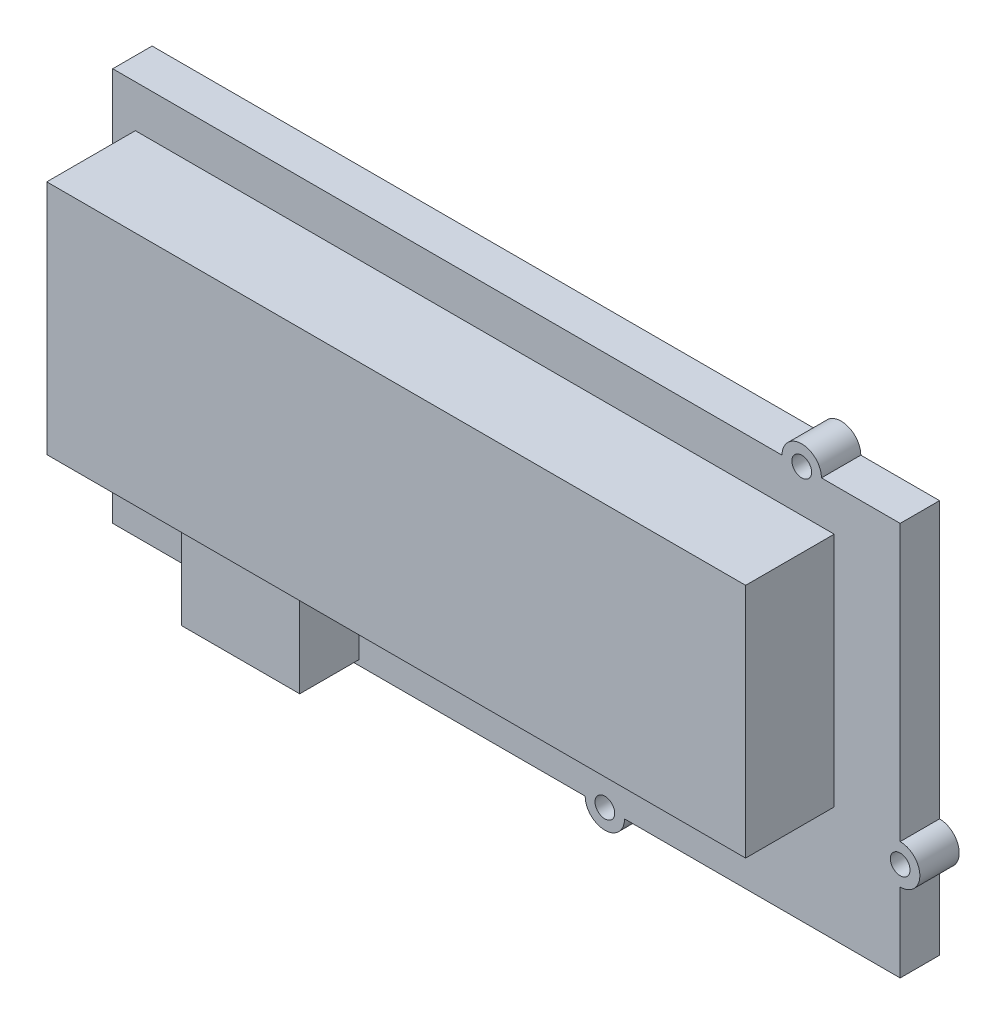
from build123d import *

# Parameters (mm, degrees)
ESQUISSE2_W             = 80
ESQUISSE2_H             = 40
BOSS_EXTRU_1_DEPTH      = 4
ESQUISSE3_R             = 2
BOSS_EXTRU_2_DEPTH      = 4
ESQUISSE4_R             = 1
ESQUISSE4_R_2           = 1.3767501
ENL_V_MAT_EXTRU_1_DEPTH = 93.217135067
ESQUISSE5_W             = 71
ESQUISSE5_H             = 24
BOSS_EXTRU_3_DEPTH      = 9
ESQUISSE6_W             = 12
ESQUISSE6_H             = 10
BOSS_EXTRU_4_DEPTH      = 6


with BuildPart() as part:
    # Esquisse2 → Boss.-Extru.1 (new body)
    with BuildSketch(Plane.XY):
        with Locations((40, 20)):
            Rectangle(ESQUISSE2_W, ESQUISSE2_H)
    extrude(amount=BOSS_EXTRU_1_DEPTH)

    # Esquisse3 → Boss.-Extru.2 (add)
    with BuildSketch(Plane.XY.offset(4)):
        with Locations((0, 30)):
            Circle(ESQUISSE3_R)
        with Locations((70, 40)):
            Circle(ESQUISSE3_R)
        with Locations((80, 10)):
            Circle(ESQUISSE3_R)
        with Locations((50, 0)):
            Circle(ESQUISSE3_R)
        with Locations((10, 0)):
            Circle(ESQUISSE3_R)
    extrude(amount=-BOSS_EXTRU_2_DEPTH)

    # Esquisse4 → Enl_v. mat.-Extru.1 (cut, through all)
    with BuildSketch(Plane.XY.offset(4)):
        with Locations((0, 30)):
            Circle(ESQUISSE4_R)
        with Locations((70, 40)):
            Circle(ESQUISSE4_R)
        with Locations((80, 10)):
            Circle(ESQUISSE4_R)
        with Locations((10, 0)):
            Circle(ESQUISSE4_R_2)
        with Locations((50, 0)):
            Circle(ESQUISSE4_R)
    extrude(amount=-ENL_V_MAT_EXTRU_1_DEPTH, mode=Mode.SUBTRACT)

    # Esquisse5 → Boss.-Extru.3 (add)
    with BuildSketch(Plane.XY.offset(4)):
        with Locations((37.8, 23.7)):
            Rectangle(ESQUISSE5_W, ESQUISSE5_H)
    extrude(amount=BOSS_EXTRU_3_DEPTH)

    # Esquisse6 → Boss.-Extru.4 (add)
    with BuildSketch(Plane.XY.offset(4)):
        with Locations((19, 5.5)):
            Rectangle(ESQUISSE6_W, ESQUISSE6_H)
    extrude(amount=BOSS_EXTRU_4_DEPTH)


solid = part.part
